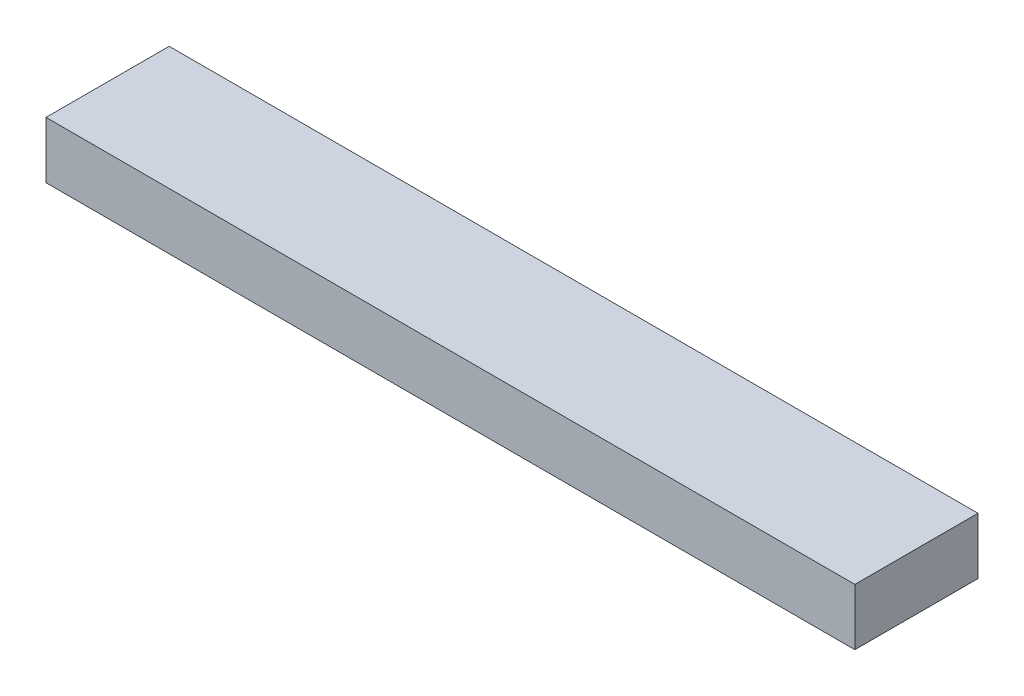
ISO-10303-21;
HEADER;
FILE_DESCRIPTION(('STEP AP214'),'2;1');
FILE_NAME('part.step','',(''),(''),'','','');
FILE_SCHEMA(('AUTOMOTIVE_DESIGN { 1 0 10303 214 1 1 1 1 }'));
ENDSEC;
DATA;
#1=APPLICATION_CONTEXT('core data for automotive mechanical design processes');
#2=APPLICATION_PROTOCOL_DEFINITION('international standard','automotive_design',2000,#1);
#3=PRODUCT_CONTEXT('',#1,'mechanical');
#4=PRODUCT('Part','Part','',(#3));
#5=PRODUCT_RELATED_PRODUCT_CATEGORY('part','',(#4));
#6=PRODUCT_DEFINITION_FORMATION('','',#4);
#7=PRODUCT_DEFINITION_CONTEXT('part definition',#1,'design');
#8=PRODUCT_DEFINITION('design','',#6,#7);
#9=PRODUCT_DEFINITION_SHAPE('','',#8);
#10=(LENGTH_UNIT() NAMED_UNIT(*) SI_UNIT(.MILLI.,.METRE.));
#11=(NAMED_UNIT(*) PLANE_ANGLE_UNIT() SI_UNIT($,.RADIAN.));
#12=(NAMED_UNIT(*) SI_UNIT($,.STERADIAN.) SOLID_ANGLE_UNIT());
#13=UNCERTAINTY_MEASURE_WITH_UNIT(LENGTH_MEASURE(1.E-05),#10,'distance_accuracy_value','');
#14=(GEOMETRIC_REPRESENTATION_CONTEXT(3) GLOBAL_UNCERTAINTY_ASSIGNED_CONTEXT((#13)) GLOBAL_UNIT_ASSIGNED_CONTEXT((#10,
#11,#12)) REPRESENTATION_CONTEXT('',''));
#15=CARTESIAN_POINT('',(0.,0.,0.));
#16=DIRECTION('',(0.,0.,1.));
#17=DIRECTION('',(1.,0.,0.));
#18=AXIS2_PLACEMENT_3D('',#15,#16,#17);
#19=CARTESIAN_POINT('',(-121.5,-8.50000000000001,37.));
#20=DIRECTION('',(1.,0.,0.));
#21=DIRECTION('',(0.,0.,-1.));
#22=AXIS2_PLACEMENT_3D('',#19,#20,#21);
#23=PLANE('',#22);
#24=DIRECTION('',(0.,-1.,0.));
#25=VECTOR('',#24,1.);
#26=CARTESIAN_POINT('',(-121.5,-8.50000000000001,0.));
#27=LINE('',#26,#25);
#28=CARTESIAN_POINT('',(-121.5,8.49999999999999,0.));
#29=VERTEX_POINT('',#28);
#30=CARTESIAN_POINT('',(-121.5,-8.50000000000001,0.));
#31=VERTEX_POINT('',#30);
#32=EDGE_CURVE('E107',#29,#31,#27,.T.);
#33=ORIENTED_EDGE('',*,*,#32,.T.);
#34=DIRECTION('',(0.,0.,-1.));
#35=VECTOR('',#34,1.);
#36=CARTESIAN_POINT('',(-121.5,-8.50000000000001,37.));
#37=LINE('',#36,#35);
#38=CARTESIAN_POINT('',(-121.5,-8.50000000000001,37.));
#39=VERTEX_POINT('',#38);
#40=EDGE_CURVE('E11',#39,#31,#37,.T.);
#41=ORIENTED_EDGE('',*,*,#40,.F.);
#42=DIRECTION('',(0.,-1.,0.));
#43=VECTOR('',#42,1.);
#44=CARTESIAN_POINT('',(-121.5,-8.50000000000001,37.));
#45=LINE('',#44,#43);
#46=CARTESIAN_POINT('',(-121.5,8.49999999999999,37.));
#47=VERTEX_POINT('',#46);
#48=EDGE_CURVE('E91',#47,#39,#45,.T.);
#49=ORIENTED_EDGE('',*,*,#48,.F.);
#50=DIRECTION('',(0.,0.,-1.));
#51=VECTOR('',#50,1.);
#52=CARTESIAN_POINT('',(-121.5,8.49999999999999,37.));
#53=LINE('',#52,#51);
#54=EDGE_CURVE('E103',#47,#29,#53,.T.);
#55=ORIENTED_EDGE('',*,*,#54,.T.);
#56=EDGE_LOOP('',(#33,#41,#49,#55));
#57=FACE_BOUND('',#56,.T.);
#58=ADVANCED_FACE('F39',(#57),#23,.F.);
#59=CARTESIAN_POINT('',(121.5,-8.49999999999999,37.));
#60=DIRECTION('',(0.,1.,0.));
#61=DIRECTION('',(-1.,0.,0.));
#62=AXIS2_PLACEMENT_3D('',#59,#60,#61);
#63=PLANE('',#62);
#64=DIRECTION('',(1.,0.,0.));
#65=VECTOR('',#64,1.);
#66=CARTESIAN_POINT('',(121.5,-8.49999999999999,0.));
#67=LINE('',#66,#65);
#68=CARTESIAN_POINT('',(121.5,-8.49999999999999,0.));
#69=VERTEX_POINT('',#68);
#70=EDGE_CURVE('E96',#31,#69,#67,.T.);
#71=ORIENTED_EDGE('',*,*,#70,.T.);
#72=DIRECTION('',(0.,0.,-1.));
#73=VECTOR('',#72,1.);
#74=CARTESIAN_POINT('',(121.5,-8.49999999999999,37.));
#75=LINE('',#74,#73);
#76=CARTESIAN_POINT('',(121.5,-8.49999999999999,37.));
#77=VERTEX_POINT('',#76);
#78=EDGE_CURVE('E48',#77,#69,#75,.T.);
#79=ORIENTED_EDGE('',*,*,#78,.F.);
#80=DIRECTION('',(1.,0.,0.));
#81=VECTOR('',#80,1.);
#82=CARTESIAN_POINT('',(121.5,-8.49999999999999,37.));
#83=LINE('',#82,#81);
#84=EDGE_CURVE('E86',#39,#77,#83,.T.);
#85=ORIENTED_EDGE('',*,*,#84,.F.);
#86=ORIENTED_EDGE('',*,*,#40,.T.);
#87=EDGE_LOOP('',(#71,#79,#85,#86));
#88=FACE_BOUND('',#87,.T.);
#89=ADVANCED_FACE('F95',(#88),#63,.F.);
#90=CARTESIAN_POINT('',(121.5,-8.49999999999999,37.));
#91=DIRECTION('',(-1.,0.,0.));
#92=DIRECTION('',(0.,0.,1.));
#93=AXIS2_PLACEMENT_3D('',#90,#91,#92);
#94=PLANE('',#93);
#95=DIRECTION('',(0.,1.,0.));
#96=VECTOR('',#95,1.);
#97=CARTESIAN_POINT('',(121.5,-8.49999999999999,0.));
#98=LINE('',#97,#96);
#99=CARTESIAN_POINT('',(121.5,8.50000000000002,0.));
#100=VERTEX_POINT('',#99);
#101=EDGE_CURVE('E73',#69,#100,#98,.T.);
#102=ORIENTED_EDGE('',*,*,#101,.T.);
#103=DIRECTION('',(0.,0.,-1.));
#104=VECTOR('',#103,1.);
#105=CARTESIAN_POINT('',(121.5,8.50000000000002,37.));
#106=LINE('',#105,#104);
#107=CARTESIAN_POINT('',(121.5,8.50000000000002,37.));
#108=VERTEX_POINT('',#107);
#109=EDGE_CURVE('E98',#108,#100,#106,.T.);
#110=ORIENTED_EDGE('',*,*,#109,.F.);
#111=DIRECTION('',(0.,1.,0.));
#112=VECTOR('',#111,1.);
#113=CARTESIAN_POINT('',(121.5,-8.49999999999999,37.));
#114=LINE('',#113,#112);
#115=EDGE_CURVE('E89',#77,#108,#114,.T.);
#116=ORIENTED_EDGE('',*,*,#115,.F.);
#117=ORIENTED_EDGE('',*,*,#78,.T.);
#118=EDGE_LOOP('',(#102,#110,#116,#117));
#119=FACE_BOUND('',#118,.T.);
#120=ADVANCED_FACE('F99',(#119),#94,.F.);
#121=CARTESIAN_POINT('',(121.5,8.50000000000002,37.));
#122=DIRECTION('',(0.,-1.,0.));
#123=DIRECTION('',(1.,0.,0.));
#124=AXIS2_PLACEMENT_3D('',#121,#122,#123);
#125=PLANE('',#124);
#126=DIRECTION('',(-1.,0.,0.));
#127=VECTOR('',#126,1.);
#128=CARTESIAN_POINT('',(121.5,8.50000000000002,0.));
#129=LINE('',#128,#127);
#130=EDGE_CURVE('E79',#100,#29,#129,.T.);
#131=ORIENTED_EDGE('',*,*,#130,.T.);
#132=ORIENTED_EDGE('',*,*,#54,.F.);
#133=DIRECTION('',(-1.,0.,0.));
#134=VECTOR('',#133,1.);
#135=CARTESIAN_POINT('',(121.5,8.50000000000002,37.));
#136=LINE('',#135,#134);
#137=EDGE_CURVE('E56',#108,#47,#136,.T.);
#138=ORIENTED_EDGE('',*,*,#137,.F.);
#139=ORIENTED_EDGE('',*,*,#109,.T.);
#140=EDGE_LOOP('',(#131,#132,#138,#139));
#141=FACE_BOUND('',#140,.T.);
#142=ADVANCED_FACE('F120',(#141),#125,.F.);
#143=CARTESIAN_POINT('',(0.,0.,37.));
#144=DIRECTION('',(0.,0.,1.));
#145=DIRECTION('',(1.,0.,0.));
#146=AXIS2_PLACEMENT_3D('',#143,#144,#145);
#147=PLANE('',#146);
#148=ORIENTED_EDGE('',*,*,#48,.T.);
#149=ORIENTED_EDGE('',*,*,#84,.T.);
#150=ORIENTED_EDGE('',*,*,#115,.T.);
#151=ORIENTED_EDGE('',*,*,#137,.T.);
#152=EDGE_LOOP('',(#148,#149,#150,#151));
#153=FACE_BOUND('',#152,.T.);
#154=ADVANCED_FACE('F87',(#153),#147,.T.);
#155=CARTESIAN_POINT('',(0.,0.,0.));
#156=DIRECTION('',(0.,0.,1.));
#157=DIRECTION('',(1.,0.,0.));
#158=AXIS2_PLACEMENT_3D('',#155,#156,#157);
#159=PLANE('',#158);
#160=ORIENTED_EDGE('',*,*,#32,.F.);
#161=ORIENTED_EDGE('',*,*,#130,.F.);
#162=ORIENTED_EDGE('',*,*,#101,.F.);
#163=ORIENTED_EDGE('',*,*,#70,.F.);
#164=EDGE_LOOP('',(#160,#161,#162,#163));
#165=FACE_BOUND('',#164,.T.);
#166=ADVANCED_FACE('F123',(#165),#159,.F.);
#167=CLOSED_SHELL('',(#58,#89,#120,#142,#154,#166));
#168=MANIFOLD_SOLID_BREP('B2',#167);
#169=ADVANCED_BREP_SHAPE_REPRESENTATION('',(#18,#168),#14);
#170=SHAPE_DEFINITION_REPRESENTATION(#9,#169);
ENDSEC;
END-ISO-10303-21;
